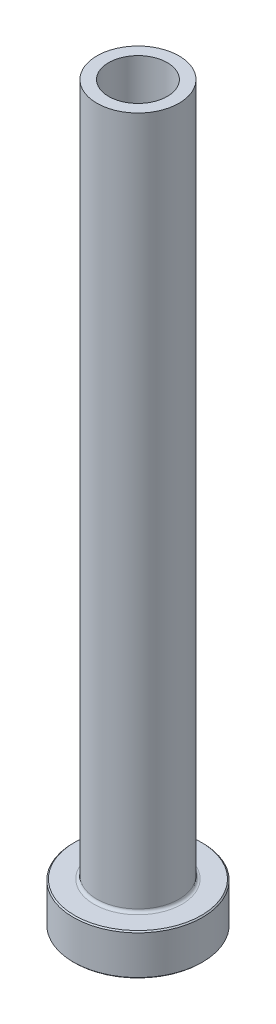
from build123d import *

# Parameters (mm, degrees)
FILLET1_R     = 0.5
CHAMFER1_SIZE = 0.2
CHAMFER3_SIZE = 0.5


with BuildPart() as part:
    # Sketch1 → Revolve1 (revolve)
    with BuildSketch(Plane.XY, mode=Mode.PRIVATE) as revolve1_sk:
        Polygon((-5, 125), (-7, 125), (-7, 7), (-11, 7), (-11, 0), (-5.25, 0), (-5.25, 68), (-5, 80), align=None)
    revolve(revolve1_sk.sketch.rotate(Axis((0, 92.187680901, 0), (0, -1, 0)), 270), axis=Axis((0, 92.187680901, 0), (0, -1, 0)))

    # Fillet1
    fillet1_edges = [part.edges().sort_by_distance(p)[0] for p in [
        (0, 7, -7),
    ]]
    fillet(fillet1_edges, radius=FILLET1_R)

    # Chamfer1
    chamfer1_edges = [part.edges().sort_by_distance(p)[0] for p in [
        (0, 0, -11),
        (0, 7, -11),
    ]]
    chamfer(chamfer1_edges, length=CHAMFER1_SIZE)

    # Chamfer3
    chamfer3_edges = [part.edges().sort_by_distance(p)[0] for p in [
        (0, 0, -5.25),
    ]]
    chamfer(chamfer3_edges, length=CHAMFER3_SIZE)


solid = part.part
